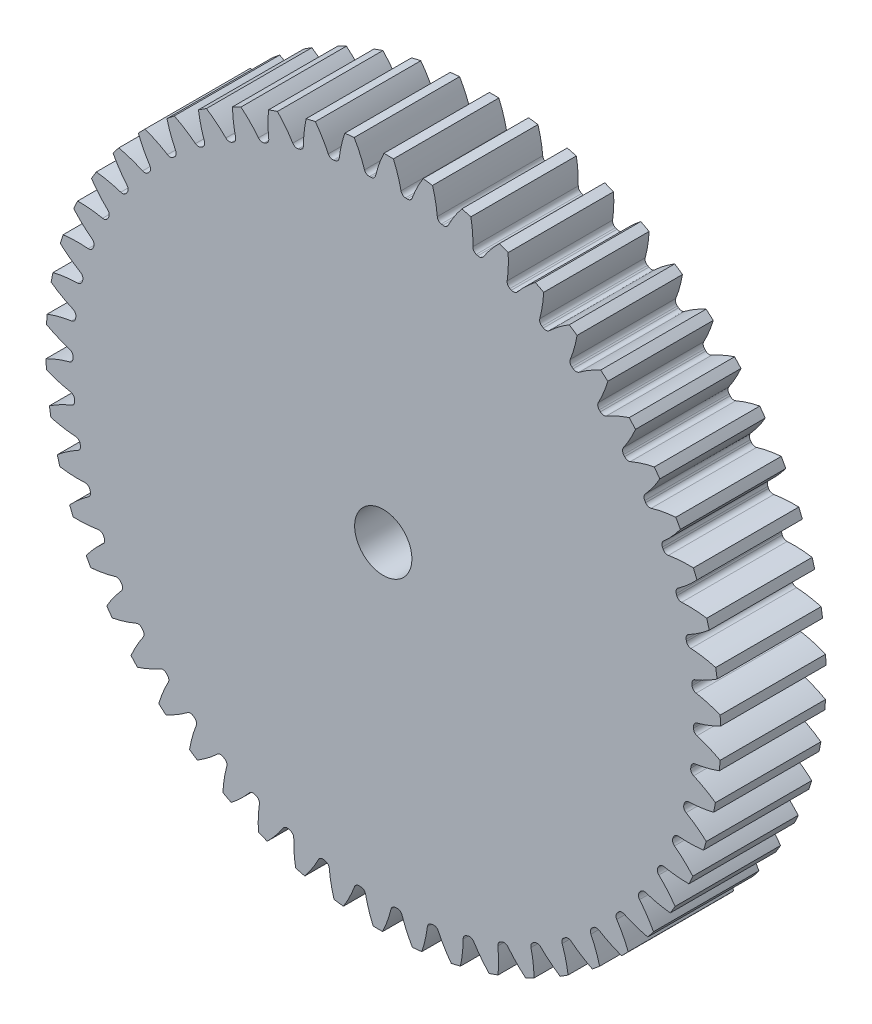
from build123d import *

# Parameters (mm, degrees)
SKETCH3_R         = 284.48
GEARBODY_DEPTH    = 88.9
TOOTHCUT_DEPTH    = 413.020570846
CIRPATTERN1_COUNT = 54
BOREDIA_R         = 24.13
BORE_DEPTH        = 12700


with BuildPart() as part:
    # Sketch3 → gearBody (new body)
    with BuildSketch(Plane.XY):
        Circle(SKETCH3_R)
    extrude(amount=GEARBODY_DEPTH)

    # Sketch2 → toothCut (cut, through all)
    with BuildSketch(Plane.XY):
        with BuildLine():
            ThreePointArc((261.574531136, -4.877403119), (261.586382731, -4.193896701), (261.596448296, -3.510361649))
            ThreePointArc((261.596448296, -3.510361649), (262.465359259, -1.029405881), (264.654062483, 0.426521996))
            ThreePointArc((264.654062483, 0.426521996), (274.767259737, 3.731291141), (284.48, 8.074208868))
            ThreePointArc((284.48, 8.074208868), (284.557989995, -4.562190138), (284.074956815, -17.189594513))
            ThreePointArc((284.074956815, -17.189594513), (274.506428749, -12.537548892), (264.504369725, -8.910280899))
            ThreePointArc((264.504369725, -8.910280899), (262.363463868, -7.384938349), (261.574531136, -4.877403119))
        make_face()
    toothcut = extrude(amount=TOOTHCUT_DEPTH, mode=Mode.SUBTRACT)

    # CirPattern1: toothCut ×54 about axis
    cirpattern1_axis = Axis((0, 0, 0), (0, 0, 1))
    for i in range(1, CIRPATTERN1_COUNT):
        add(toothcut.rotate(cirpattern1_axis, i * 360 / CIRPATTERN1_COUNT), mode=Mode.SUBTRACT)

    # boreDia → bore (cut, symmetric)
    with BuildSketch(Plane.XY):
        Circle(BOREDIA_R)
    extrude(amount=BORE_DEPTH, both=True, mode=Mode.SUBTRACT)


solid = part.part
